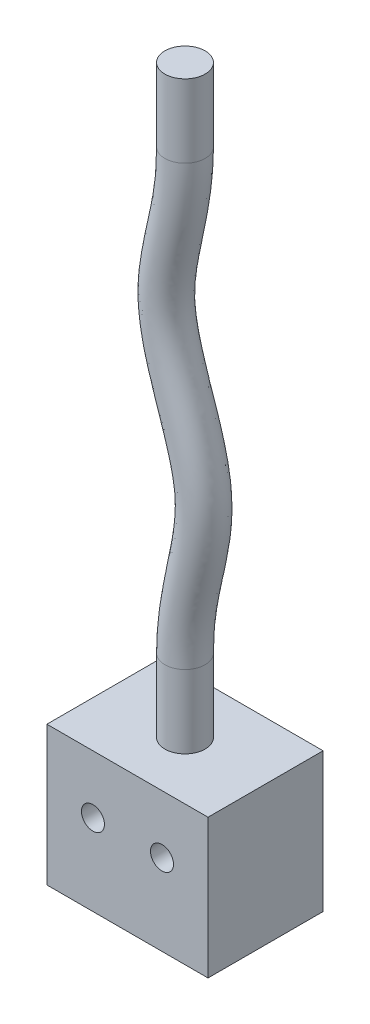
ISO-10303-21;
HEADER;
FILE_DESCRIPTION(('STEP AP214'),'2;1');
FILE_NAME('part.step','',(''),(''),'','','');
FILE_SCHEMA(('AUTOMOTIVE_DESIGN { 1 0 10303 214 1 1 1 1 }'));
ENDSEC;
DATA;
#1=APPLICATION_CONTEXT('core data for automotive mechanical design processes');
#2=APPLICATION_PROTOCOL_DEFINITION('international standard','automotive_design',2000,#1);
#3=PRODUCT_CONTEXT('',#1,'mechanical');
#4=PRODUCT('Part','Part','',(#3));
#5=PRODUCT_RELATED_PRODUCT_CATEGORY('part','',(#4));
#6=PRODUCT_DEFINITION_FORMATION('','',#4);
#7=PRODUCT_DEFINITION_CONTEXT('part definition',#1,'design');
#8=PRODUCT_DEFINITION('design','',#6,#7);
#9=PRODUCT_DEFINITION_SHAPE('','',#8);
#10=(LENGTH_UNIT() NAMED_UNIT(*) SI_UNIT(.MILLI.,.METRE.));
#11=(NAMED_UNIT(*) PLANE_ANGLE_UNIT() SI_UNIT($,.RADIAN.));
#12=(NAMED_UNIT(*) SI_UNIT($,.STERADIAN.) SOLID_ANGLE_UNIT());
#13=UNCERTAINTY_MEASURE_WITH_UNIT(LENGTH_MEASURE(1.E-05),#10,'distance_accuracy_value','');
#14=(GEOMETRIC_REPRESENTATION_CONTEXT(3) GLOBAL_UNCERTAINTY_ASSIGNED_CONTEXT((#13)) GLOBAL_UNIT_ASSIGNED_CONTEXT((#10,
#11,#12)) REPRESENTATION_CONTEXT('',''));
#15=CARTESIAN_POINT('',(0.,0.,0.));
#16=DIRECTION('',(0.,0.,1.));
#17=DIRECTION('',(1.,0.,0.));
#18=AXIS2_PLACEMENT_3D('',#15,#16,#17);
#19=CARTESIAN_POINT('',(-7.,6.05,5.));
#20=DIRECTION('',(0.,-1.,0.));
#21=DIRECTION('',(0.,0.,-1.));
#22=AXIS2_PLACEMENT_3D('',#19,#20,#21);
#23=PLANE('',#22);
#24=DIRECTION('',(-1.,0.,0.));
#25=VECTOR('',#24,1.);
#26=CARTESIAN_POINT('',(-7.,6.05,-5.));
#27=LINE('',#26,#25);
#28=CARTESIAN_POINT('',(7.,6.05,-5.));
#29=VERTEX_POINT('',#28);
#30=CARTESIAN_POINT('',(-7.,6.05,-5.));
#31=VERTEX_POINT('',#30);
#32=EDGE_CURVE('E89',#29,#31,#27,.T.);
#33=ORIENTED_EDGE('',*,*,#32,.T.);
#34=DIRECTION('',(0.,0.,-1.));
#35=VECTOR('',#34,1.);
#36=CARTESIAN_POINT('',(-7.,6.05,5.));
#37=LINE('',#36,#35);
#38=CARTESIAN_POINT('',(-7.,6.05,5.));
#39=VERTEX_POINT('',#38);
#40=EDGE_CURVE('E111',#39,#31,#37,.T.);
#41=ORIENTED_EDGE('',*,*,#40,.F.);
#42=DIRECTION('',(-1.,0.,0.));
#43=VECTOR('',#42,1.);
#44=CARTESIAN_POINT('',(-7.,6.05,5.));
#45=LINE('',#44,#43);
#46=CARTESIAN_POINT('',(7.,6.05,5.));
#47=VERTEX_POINT('',#46);
#48=EDGE_CURVE('E66',#47,#39,#45,.T.);
#49=ORIENTED_EDGE('',*,*,#48,.F.);
#50=DIRECTION('',(0.,0.,-1.));
#51=VECTOR('',#50,1.);
#52=CARTESIAN_POINT('',(7.,6.05,5.));
#53=LINE('',#52,#51);
#54=EDGE_CURVE('E108',#47,#29,#53,.T.);
#55=ORIENTED_EDGE('',*,*,#54,.T.);
#56=EDGE_LOOP('',(#33,#41,#49,#55));
#57=FACE_BOUND('',#56,.T.);
#58=CARTESIAN_POINT('',(0.,6.05,0.));
#59=DIRECTION('',(0.,1.,0.));
#60=DIRECTION('',(0.,0.,1.));
#61=AXIS2_PLACEMENT_3D('',#58,#59,#60);
#62=CIRCLE('',#61,1.75);
#63=CARTESIAN_POINT('',(0.,6.05,-1.75));
#64=VERTEX_POINT('',#63);
#65=EDGE_CURVE('E12',#64,#64,#62,.T.);
#66=ORIENTED_EDGE('',*,*,#65,.F.);
#67=EDGE_LOOP('',(#66));
#68=FACE_BOUND('',#67,.T.);
#69=ADVANCED_FACE('F48',(#57,#68),#23,.F.);
#70=CARTESIAN_POINT('',(-7.,6.05,5.));
#71=DIRECTION('',(1.,0.,0.));
#72=DIRECTION('',(0.,1.,0.));
#73=AXIS2_PLACEMENT_3D('',#70,#71,#72);
#74=PLANE('',#73);
#75=DIRECTION('',(0.,-1.,0.));
#76=VECTOR('',#75,1.);
#77=CARTESIAN_POINT('',(-7.,6.05,-5.));
#78=LINE('',#77,#76);
#79=CARTESIAN_POINT('',(-7.,-6.05,-5.));
#80=VERTEX_POINT('',#79);
#81=EDGE_CURVE('E115',#31,#80,#78,.T.);
#82=ORIENTED_EDGE('',*,*,#81,.T.);
#83=DIRECTION('',(0.,0.,-1.));
#84=VECTOR('',#83,1.);
#85=CARTESIAN_POINT('',(-7.,-6.05,5.));
#86=LINE('',#85,#84);
#87=CARTESIAN_POINT('',(-7.,-6.05,5.));
#88=VERTEX_POINT('',#87);
#89=EDGE_CURVE('E52',#88,#80,#86,.T.);
#90=ORIENTED_EDGE('',*,*,#89,.F.);
#91=DIRECTION('',(0.,-1.,0.));
#92=VECTOR('',#91,1.);
#93=CARTESIAN_POINT('',(-7.,6.05,5.));
#94=LINE('',#93,#92);
#95=EDGE_CURVE('E102',#39,#88,#94,.T.);
#96=ORIENTED_EDGE('',*,*,#95,.F.);
#97=ORIENTED_EDGE('',*,*,#40,.T.);
#98=EDGE_LOOP('',(#82,#90,#96,#97));
#99=FACE_BOUND('',#98,.T.);
#100=ADVANCED_FACE('F50',(#99),#74,.F.);
#101=CARTESIAN_POINT('',(-7.,-6.05,5.));
#102=DIRECTION('',(0.,1.,0.));
#103=DIRECTION('',(0.,0.,1.));
#104=AXIS2_PLACEMENT_3D('',#101,#102,#103);
#105=PLANE('',#104);
#106=DIRECTION('',(1.,0.,0.));
#107=VECTOR('',#106,1.);
#108=CARTESIAN_POINT('',(-7.,-6.05,-5.));
#109=LINE('',#108,#107);
#110=CARTESIAN_POINT('',(7.,-6.05,-5.));
#111=VERTEX_POINT('',#110);
#112=EDGE_CURVE('E107',#80,#111,#109,.T.);
#113=ORIENTED_EDGE('',*,*,#112,.T.);
#114=DIRECTION('',(0.,0.,-1.));
#115=VECTOR('',#114,1.);
#116=CARTESIAN_POINT('',(7.,-6.05,5.));
#117=LINE('',#116,#115);
#118=CARTESIAN_POINT('',(7.,-6.05,5.));
#119=VERTEX_POINT('',#118);
#120=EDGE_CURVE('E105',#119,#111,#117,.T.);
#121=ORIENTED_EDGE('',*,*,#120,.F.);
#122=DIRECTION('',(1.,0.,0.));
#123=VECTOR('',#122,1.);
#124=CARTESIAN_POINT('',(-7.,-6.05,5.));
#125=LINE('',#124,#123);
#126=EDGE_CURVE('E97',#88,#119,#125,.T.);
#127=ORIENTED_EDGE('',*,*,#126,.F.);
#128=ORIENTED_EDGE('',*,*,#89,.T.);
#129=EDGE_LOOP('',(#113,#121,#127,#128));
#130=FACE_BOUND('',#129,.T.);
#131=ADVANCED_FACE('F106',(#130),#105,.F.);
#132=CARTESIAN_POINT('',(7.,6.05,5.));
#133=DIRECTION('',(-1.,0.,0.));
#134=DIRECTION('',(0.,-1.,0.));
#135=AXIS2_PLACEMENT_3D('',#132,#133,#134);
#136=PLANE('',#135);
#137=DIRECTION('',(0.,1.,0.));
#138=VECTOR('',#137,1.);
#139=CARTESIAN_POINT('',(7.,6.05,-5.));
#140=LINE('',#139,#138);
#141=EDGE_CURVE('E83',#111,#29,#140,.T.);
#142=ORIENTED_EDGE('',*,*,#141,.T.);
#143=ORIENTED_EDGE('',*,*,#54,.F.);
#144=DIRECTION('',(0.,1.,0.));
#145=VECTOR('',#144,1.);
#146=CARTESIAN_POINT('',(7.,6.05,5.));
#147=LINE('',#146,#145);
#148=EDGE_CURVE('E100',#119,#47,#147,.T.);
#149=ORIENTED_EDGE('',*,*,#148,.F.);
#150=ORIENTED_EDGE('',*,*,#120,.T.);
#151=EDGE_LOOP('',(#142,#143,#149,#150));
#152=FACE_BOUND('',#151,.T.);
#153=ADVANCED_FACE('F109',(#152),#136,.F.);
#154=CARTESIAN_POINT('',(-7.,-6.05,5.));
#155=DIRECTION('',(0.,0.,1.));
#156=DIRECTION('',(1.,0.,0.));
#157=AXIS2_PLACEMENT_3D('',#154,#155,#156);
#158=PLANE('',#157);
#159=CARTESIAN_POINT('',(3.,1.,5.));
#160=DIRECTION('',(0.,0.,1.));
#161=DIRECTION('',(-1.,0.,0.));
#162=AXIS2_PLACEMENT_3D('',#159,#160,#161);
#163=CIRCLE('',#162,1.);
#164=CARTESIAN_POINT('',(2.,1.,5.));
#165=VERTEX_POINT('',#164);
#166=EDGE_CURVE('E135',#165,#165,#163,.T.);
#167=ORIENTED_EDGE('',*,*,#166,.F.);
#168=EDGE_LOOP('',(#167));
#169=FACE_BOUND('',#168,.T.);
#170=CARTESIAN_POINT('',(-3.,1.,5.));
#171=DIRECTION('',(0.,0.,1.));
#172=DIRECTION('',(1.,0.,0.));
#173=AXIS2_PLACEMENT_3D('',#170,#171,#172);
#174=CIRCLE('',#173,1.);
#175=CARTESIAN_POINT('',(-2.,1.,5.));
#176=VERTEX_POINT('',#175);
#177=EDGE_CURVE('E129',#176,#176,#174,.T.);
#178=ORIENTED_EDGE('',*,*,#177,.F.);
#179=EDGE_LOOP('',(#178));
#180=FACE_BOUND('',#179,.T.);
#181=ORIENTED_EDGE('',*,*,#95,.T.);
#182=ORIENTED_EDGE('',*,*,#126,.T.);
#183=ORIENTED_EDGE('',*,*,#148,.T.);
#184=ORIENTED_EDGE('',*,*,#48,.T.);
#185=EDGE_LOOP('',(#181,#182,#183,#184));
#186=FACE_BOUND('',#185,.T.);
#187=ADVANCED_FACE('F98',(#169,#180,#186),#158,.T.);
#188=CARTESIAN_POINT('',(-7.,-6.05,-5.));
#189=DIRECTION('',(0.,0.,1.));
#190=DIRECTION('',(1.,0.,0.));
#191=AXIS2_PLACEMENT_3D('',#188,#189,#190);
#192=PLANE('',#191);
#193=ORIENTED_EDGE('',*,*,#81,.F.);
#194=ORIENTED_EDGE('',*,*,#32,.F.);
#195=ORIENTED_EDGE('',*,*,#141,.F.);
#196=ORIENTED_EDGE('',*,*,#112,.F.);
#197=EDGE_LOOP('',(#193,#194,#195,#196));
#198=FACE_BOUND('',#197,.T.);
#199=ADVANCED_FACE('F126',(#198),#192,.F.);
#200=CARTESIAN_POINT('',(-3.,1.,0.));
#201=DIRECTION('',(0.,0.,1.));
#202=DIRECTION('',(1.,0.,0.));
#203=AXIS2_PLACEMENT_3D('',#200,#201,#202);
#204=CYLINDRICAL_SURFACE('',#203,1.);
#205=CARTESIAN_POINT('',(-3.,1.,0.));
#206=DIRECTION('',(0.,0.,1.));
#207=DIRECTION('',(1.,0.,0.));
#208=AXIS2_PLACEMENT_3D('',#205,#206,#207);
#209=CIRCLE('',#208,1.);
#210=CARTESIAN_POINT('',(-2.,1.,0.));
#211=VERTEX_POINT('',#210);
#212=EDGE_CURVE('E118',#211,#211,#209,.T.);
#213=ORIENTED_EDGE('',*,*,#212,.F.);
#214=EDGE_LOOP('',(#213));
#215=FACE_BOUND('',#214,.T.);
#216=ORIENTED_EDGE('',*,*,#177,.T.);
#217=EDGE_LOOP('',(#216));
#218=FACE_BOUND('',#217,.T.);
#219=ADVANCED_FACE('F197',(#215,#218),#204,.F.);
#220=CARTESIAN_POINT('',(-3.,1.,0.));
#221=DIRECTION('',(0.,0.,1.));
#222=DIRECTION('',(1.,0.,0.));
#223=AXIS2_PLACEMENT_3D('',#220,#221,#222);
#224=PLANE('',#223);
#225=ORIENTED_EDGE('',*,*,#212,.T.);
#226=EDGE_LOOP('',(#225));
#227=FACE_BOUND('',#226,.T.);
#228=ADVANCED_FACE('F202',(#227),#224,.T.);
#229=CARTESIAN_POINT('',(3.,1.,0.));
#230=DIRECTION('',(0.,0.,1.));
#231=DIRECTION('',(1.,0.,0.));
#232=AXIS2_PLACEMENT_3D('',#229,#230,#231);
#233=CYLINDRICAL_SURFACE('',#232,1.);
#234=CARTESIAN_POINT('',(3.,1.,0.));
#235=DIRECTION('',(0.,0.,1.));
#236=DIRECTION('',(-1.,0.,0.));
#237=AXIS2_PLACEMENT_3D('',#234,#235,#236);
#238=CIRCLE('',#237,1.);
#239=CARTESIAN_POINT('',(2.,1.,0.));
#240=VERTEX_POINT('',#239);
#241=EDGE_CURVE('E132',#240,#240,#238,.T.);
#242=ORIENTED_EDGE('',*,*,#241,.F.);
#243=EDGE_LOOP('',(#242));
#244=FACE_BOUND('',#243,.T.);
#245=ORIENTED_EDGE('',*,*,#166,.T.);
#246=EDGE_LOOP('',(#245));
#247=FACE_BOUND('',#246,.T.);
#248=ADVANCED_FACE('F210',(#244,#247),#233,.F.);
#249=CARTESIAN_POINT('',(3.,1.,0.));
#250=DIRECTION('',(0.,0.,-1.));
#251=DIRECTION('',(-1.,0.,0.));
#252=AXIS2_PLACEMENT_3D('',#249,#250,#251);
#253=PLANE('',#252);
#254=ORIENTED_EDGE('',*,*,#241,.T.);
#255=EDGE_LOOP('',(#254));
#256=FACE_BOUND('',#255,.T.);
#257=ADVANCED_FACE('F218',(#256),#253,.F.);
#258=CARTESIAN_POINT('',(0.,50.5,0.));
#259=DIRECTION('',(0.,1.,0.));
#260=DIRECTION('',(-1.,0.,0.));
#261=AXIS2_PLACEMENT_3D('',#258,#259,#260);
#262=CYLINDRICAL_SURFACE('',#261,1.75);
#263=CARTESIAN_POINT('',(0.,50.5,0.));
#264=DIRECTION('',(0.,1.,0.));
#265=DIRECTION('',(0.,0.,1.));
#266=AXIS2_PLACEMENT_3D('',#263,#264,#265);
#267=CIRCLE('',#266,1.75);
#268=CARTESIAN_POINT('',(0.,50.5,1.75));
#269=VERTEX_POINT('',#268);
#270=EDGE_CURVE('E146',#269,#269,#267,.T.);
#271=ORIENTED_EDGE('',*,*,#270,.T.);
#272=EDGE_LOOP('',(#271));
#273=FACE_BOUND('',#272,.T.);
#274=CARTESIAN_POINT('',(0.,56.85,0.));
#275=DIRECTION('',(0.,1.,0.));
#276=DIRECTION('',(0.,0.,1.));
#277=AXIS2_PLACEMENT_3D('',#274,#275,#276);
#278=CIRCLE('',#277,1.75);
#279=CARTESIAN_POINT('',(0.,56.85,1.75));
#280=VERTEX_POINT('',#279);
#281=EDGE_CURVE('E138',#280,#280,#278,.T.);
#282=ORIENTED_EDGE('',*,*,#281,.F.);
#283=EDGE_LOOP('',(#282));
#284=FACE_BOUND('',#283,.T.);
#285=ADVANCED_FACE('F150',(#273,#284),#262,.T.);
#286=CARTESIAN_POINT('',(0.,12.4,0.));
#287=DIRECTION('',(0.,-1.,0.));
#288=DIRECTION('',(0.,0.,-1.));
#289=AXIS2_PLACEMENT_3D('',#286,#287,#288);
#290=CYLINDRICAL_SURFACE('',#289,1.75);
#291=CARTESIAN_POINT('',(0.,12.4,0.));
#292=DIRECTION('',(0.,1.,0.));
#293=DIRECTION('',(0.,0.,1.));
#294=AXIS2_PLACEMENT_3D('',#291,#292,#293);
#295=CIRCLE('',#294,1.75);
#296=CARTESIAN_POINT('',(0.,12.4,-1.75));
#297=VERTEX_POINT('',#296);
#298=EDGE_CURVE('E142',#297,#297,#295,.T.);
#299=CARTESIAN_POINT('',(0.,12.4,-1.75));
#300=CARTESIAN_POINT('',(0.,12.3338541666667,-1.75));
#301=CARTESIAN_POINT('',(0.,12.2677083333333,-1.75));
#302=CARTESIAN_POINT('',(0.,12.1354166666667,-1.75));
#303=CARTESIAN_POINT('',(0.,12.0692708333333,-1.75));
#304=CARTESIAN_POINT('',(0.,11.9369791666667,-1.75));
#305=CARTESIAN_POINT('',(0.,11.8708333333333,-1.75));
#306=CARTESIAN_POINT('',(0.,11.7385416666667,-1.75));
#307=CARTESIAN_POINT('',(0.,11.6723958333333,-1.75));
#308=CARTESIAN_POINT('',(0.,11.5401041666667,-1.75));
#309=CARTESIAN_POINT('',(0.,11.4739583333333,-1.75));
#310=CARTESIAN_POINT('',(0.,11.3416666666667,-1.75));
#311=CARTESIAN_POINT('',(0.,11.2755208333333,-1.75));
#312=CARTESIAN_POINT('',(0.,11.1432291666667,-1.75));
#313=CARTESIAN_POINT('',(0.,11.0770833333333,-1.75));
#314=CARTESIAN_POINT('',(0.,10.9447916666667,-1.75));
#315=CARTESIAN_POINT('',(0.,10.8786458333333,-1.75));
#316=CARTESIAN_POINT('',(0.,10.7463541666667,-1.75));
#317=CARTESIAN_POINT('',(0.,10.6802083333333,-1.75));
#318=CARTESIAN_POINT('',(0.,10.5479166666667,-1.75));
#319=CARTESIAN_POINT('',(0.,10.4817708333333,-1.75));
#320=CARTESIAN_POINT('',(0.,10.3494791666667,-1.75));
#321=CARTESIAN_POINT('',(0.,10.2833333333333,-1.75));
#322=CARTESIAN_POINT('',(0.,10.1510416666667,-1.75));
#323=CARTESIAN_POINT('',(0.,10.0848958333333,-1.75));
#324=CARTESIAN_POINT('',(0.,9.95260416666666,-1.75));
#325=CARTESIAN_POINT('',(0.,9.88645833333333,-1.75));
#326=CARTESIAN_POINT('',(0.,9.75416666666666,-1.75));
#327=CARTESIAN_POINT('',(0.,9.68802083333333,-1.75));
#328=CARTESIAN_POINT('',(0.,9.55572916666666,-1.75));
#329=CARTESIAN_POINT('',(0.,9.48958333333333,-1.75));
#330=CARTESIAN_POINT('',(0.,9.35729166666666,-1.75));
#331=CARTESIAN_POINT('',(0.,9.29114583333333,-1.75));
#332=CARTESIAN_POINT('',(0.,9.15885416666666,-1.75));
#333=CARTESIAN_POINT('',(0.,9.09270833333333,-1.75));
#334=CARTESIAN_POINT('',(0.,8.96041666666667,-1.75));
#335=CARTESIAN_POINT('',(0.,8.89427083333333,-1.75));
#336=CARTESIAN_POINT('',(0.,8.76197916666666,-1.75));
#337=CARTESIAN_POINT('',(0.,8.69583333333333,-1.75));
#338=CARTESIAN_POINT('',(0.,8.56354166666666,-1.75));
#339=CARTESIAN_POINT('',(0.,8.49739583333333,-1.75));
#340=CARTESIAN_POINT('',(0.,8.36510416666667,-1.75));
#341=CARTESIAN_POINT('',(0.,8.29895833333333,-1.75));
#342=CARTESIAN_POINT('',(0.,8.16666666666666,-1.75));
#343=CARTESIAN_POINT('',(0.,8.10052083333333,-1.75));
#344=CARTESIAN_POINT('',(0.,7.96822916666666,-1.75));
#345=CARTESIAN_POINT('',(0.,7.90208333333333,-1.75));
#346=CARTESIAN_POINT('',(0.,7.76979166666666,-1.75));
#347=CARTESIAN_POINT('',(0.,7.70364583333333,-1.75));
#348=CARTESIAN_POINT('',(0.,7.57135416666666,-1.75));
#349=CARTESIAN_POINT('',(0.,7.50520833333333,-1.75));
#350=CARTESIAN_POINT('',(0.,7.37291666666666,-1.75));
#351=CARTESIAN_POINT('',(0.,7.30677083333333,-1.75));
#352=CARTESIAN_POINT('',(0.,7.17447916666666,-1.75));
#353=CARTESIAN_POINT('',(0.,7.10833333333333,-1.75));
#354=CARTESIAN_POINT('',(0.,6.97604166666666,-1.75));
#355=CARTESIAN_POINT('',(0.,6.90989583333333,-1.75));
#356=CARTESIAN_POINT('',(0.,6.77760416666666,-1.75));
#357=CARTESIAN_POINT('',(0.,6.71145833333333,-1.75));
#358=CARTESIAN_POINT('',(0.,6.57916666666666,-1.75));
#359=CARTESIAN_POINT('',(0.,6.51302083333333,-1.75));
#360=CARTESIAN_POINT('',(0.,6.38072916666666,-1.75));
#361=CARTESIAN_POINT('',(0.,6.31458333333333,-1.75));
#362=CARTESIAN_POINT('',(0.,6.18229166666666,-1.75));
#363=CARTESIAN_POINT('',(0.,6.11614583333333,-1.75));
#364=CARTESIAN_POINT('',(0.,6.05,-1.75));
#365=B_SPLINE_CURVE_WITH_KNOTS('',3,(#299,#300,#301,#302,#303,#304,#305,#306,#307,#308,#309,
#310,#311,#312,#313,#314,#315,#316,#317,#318,#319,#320,#321,#322,#323,#324,#325,#326,#327,#328,
#329,#330,#331,#332,#333,#334,#335,#336,#337,#338,#339,#340,#341,#342,#343,#344,#345,#346,#347,
#348,#349,#350,#351,#352,#353,#354,#355,#356,#357,#358,#359,#360,#361,#362,#363,#364),
.UNSPECIFIED.,.F.,.F.,(4,2,2,2,2,2,2,2,2,2,2,2,2,2,2,2,2,2,2,2,2,2,2,2,2,2,2,2,2,2,2,2,4),(0.,
0.198437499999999,0.396875,0.595312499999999,0.793749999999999,0.992187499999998,1.190625,
1.3890625,1.5875,1.7859375,1.984375,2.1828125,2.38125,2.5796875,2.778125,2.9765625,3.175,
3.3734375,3.571875,3.7703125,3.96875,4.1671875,4.365625,4.5640625,4.7625,4.9609375,5.159375,
5.3578125,5.55625,5.7546875,5.953125,6.1515625,6.35),.UNSPECIFIED.);
#366=EDGE_CURVE('BSEAM161',#297,#64,#365,.T.);
#367=ORIENTED_EDGE('',*,*,#298,.F.);
#368=ORIENTED_EDGE('',*,*,#65,.T.);
#369=ORIENTED_EDGE('',*,*,#366,.T.);
#370=ORIENTED_EDGE('',*,*,#366,.F.);
#371=EDGE_LOOP('',(#367,#369,#368,#370));
#372=FACE_BOUND('',#371,.T.);
#373=ADVANCED_FACE('F161',(#372),#290,.T.);
#374=CARTESIAN_POINT('',(0.,56.85,0.));
#375=DIRECTION('',(0.,1.,0.));
#376=DIRECTION('',(0.,0.,1.));
#377=AXIS2_PLACEMENT_3D('',#374,#375,#376);
#378=PLANE('',#377);
#379=ORIENTED_EDGE('',*,*,#281,.T.);
#380=EDGE_LOOP('',(#379));
#381=FACE_BOUND('',#380,.T.);
#382=ADVANCED_FACE('F155',(#381),#378,.T.);
#383=CARTESIAN_POINT('',(0.,12.4,1.75));
#384=CARTESIAN_POINT('',(0.,14.5840851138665,1.75));
#385=CARTESIAN_POINT('',(0.673718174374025,18.372697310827,1.75));
#386=CARTESIAN_POINT('',(1.6091598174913,22.2213143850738,1.75));
#387=CARTESIAN_POINT('',(1.64351345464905,25.5446698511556,1.75));
#388=CARTESIAN_POINT('',(0.899052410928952,29.030360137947,1.75));
#389=CARTESIAN_POINT('',(-0.729124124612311,33.3880527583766,1.75));
#390=CARTESIAN_POINT('',(-1.60521870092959,36.959787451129,1.75));
#391=CARTESIAN_POINT('',(-1.64693404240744,40.4228730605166,1.75));
#392=CARTESIAN_POINT('',(-0.739409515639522,44.2008563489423,1.75));
#393=CARTESIAN_POINT('',(0.,48.1653714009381,1.75));
#394=CARTESIAN_POINT('',(0.,50.5,1.75));
#395=CARTESIAN_POINT('',(3.5,12.4,1.75));
#396=CARTESIAN_POINT('',(3.5,14.5840851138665,1.75));
#397=CARTESIAN_POINT('',(4.03051799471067,17.2631833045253,1.75));
#398=CARTESIAN_POINT('',(5.12697413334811,21.6762781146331,1.75));
#399=CARTESIAN_POINT('',(5.10649050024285,25.8687726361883,1.75));
#400=CARTESIAN_POINT('',(4.23810356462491,30.2247268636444,1.75));
#401=CARTESIAN_POINT('',(2.57044853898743,34.6433214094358,1.75));
#402=CARTESIAN_POINT('',(1.8578424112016,37.365722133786,1.75));
#403=CARTESIAN_POINT('',(1.88028100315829,39.9609570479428,1.75));
#404=CARTESIAN_POINT('',(2.60631479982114,43.0263243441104,1.75));
#405=CARTESIAN_POINT('',(3.5,48.1653714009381,1.75));
#406=CARTESIAN_POINT('',(3.5,50.5,1.75));
#407=CARTESIAN_POINT('',(3.5,12.4,-1.75));
#408=CARTESIAN_POINT('',(3.5,14.5840851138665,-1.75));
#409=CARTESIAN_POINT('',(4.03051799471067,17.2631833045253,-1.75));
#410=CARTESIAN_POINT('',(5.12697413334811,21.6762781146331,-1.75));
#411=CARTESIAN_POINT('',(5.10649050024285,25.8687726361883,-1.75));
#412=CARTESIAN_POINT('',(4.23810356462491,30.2247268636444,-1.75));
#413=CARTESIAN_POINT('',(2.57044853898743,34.6433214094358,-1.75));
#414=CARTESIAN_POINT('',(1.8578424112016,37.365722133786,-1.75));
#415=CARTESIAN_POINT('',(1.88028100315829,39.9609570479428,-1.75));
#416=CARTESIAN_POINT('',(2.60631479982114,43.0263243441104,-1.75));
#417=CARTESIAN_POINT('',(3.5,48.1653714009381,-1.75));
#418=CARTESIAN_POINT('',(3.5,50.5,-1.75));
#419=CARTESIAN_POINT('',(0.,12.4,-1.75));
#420=CARTESIAN_POINT('',(0.,14.5840851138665,-1.75));
#421=CARTESIAN_POINT('',(0.673718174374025,18.372697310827,-1.75));
#422=CARTESIAN_POINT('',(1.6091598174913,22.2213143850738,-1.75));
#423=CARTESIAN_POINT('',(1.64351345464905,25.5446698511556,-1.75));
#424=CARTESIAN_POINT('',(0.899052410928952,29.030360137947,-1.75));
#425=CARTESIAN_POINT('',(-0.729124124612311,33.3880527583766,-1.75));
#426=CARTESIAN_POINT('',(-1.60521870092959,36.959787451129,-1.75));
#427=CARTESIAN_POINT('',(-1.64693404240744,40.4228730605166,-1.75));
#428=CARTESIAN_POINT('',(-0.739409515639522,44.2008563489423,-1.75));
#429=CARTESIAN_POINT('',(0.,48.1653714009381,-1.75));
#430=CARTESIAN_POINT('',(0.,50.5,-1.75));
#431=CARTESIAN_POINT('',(-3.5,12.4,-1.75));
#432=CARTESIAN_POINT('',(-3.5,14.5840851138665,-1.75));
#433=CARTESIAN_POINT('',(-2.68308164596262,19.4822113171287,-1.75));
#434=CARTESIAN_POINT('',(-1.90865449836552,22.7663506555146,-1.75));
#435=CARTESIAN_POINT('',(-1.81946359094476,25.2205670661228,-1.75));
#436=CARTESIAN_POINT('',(-2.43999874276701,27.8359934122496,-1.75));
#437=CARTESIAN_POINT('',(-4.02869678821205,32.1327841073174,-1.75));
#438=CARTESIAN_POINT('',(-5.06827981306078,36.553852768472,-1.75));
#439=CARTESIAN_POINT('',(-5.17414908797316,40.8847890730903,-1.75));
#440=CARTESIAN_POINT('',(-4.08513383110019,45.3753883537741,-1.75));
#441=CARTESIAN_POINT('',(-3.5,48.1653714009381,-1.75));
#442=CARTESIAN_POINT('',(-3.5,50.5,-1.75));
#443=CARTESIAN_POINT('',(-3.5,12.4,1.75));
#444=CARTESIAN_POINT('',(-3.5,14.5840851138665,1.75));
#445=CARTESIAN_POINT('',(-2.68308164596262,19.4822113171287,1.75));
#446=CARTESIAN_POINT('',(-1.90865449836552,22.7663506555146,1.75));
#447=CARTESIAN_POINT('',(-1.81946359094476,25.2205670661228,1.75));
#448=CARTESIAN_POINT('',(-2.43999874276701,27.8359934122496,1.75));
#449=CARTESIAN_POINT('',(-4.02869678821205,32.1327841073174,1.75));
#450=CARTESIAN_POINT('',(-5.06827981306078,36.553852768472,1.75));
#451=CARTESIAN_POINT('',(-5.17414908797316,40.8847890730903,1.75));
#452=CARTESIAN_POINT('',(-4.08513383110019,45.3753883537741,1.75));
#453=CARTESIAN_POINT('',(-3.5,48.1653714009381,1.75));
#454=CARTESIAN_POINT('',(-3.5,50.5,1.75));
#455=CARTESIAN_POINT('',(0.,12.4,1.75));
#456=CARTESIAN_POINT('',(0.,14.5840851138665,1.75));
#457=CARTESIAN_POINT('',(0.673718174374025,18.372697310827,1.75));
#458=CARTESIAN_POINT('',(1.6091598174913,22.2213143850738,1.75));
#459=CARTESIAN_POINT('',(1.64351345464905,25.5446698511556,1.75));
#460=CARTESIAN_POINT('',(0.899052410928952,29.030360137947,1.75));
#461=CARTESIAN_POINT('',(-0.729124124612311,33.3880527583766,1.75));
#462=CARTESIAN_POINT('',(-1.60521870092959,36.959787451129,1.75));
#463=CARTESIAN_POINT('',(-1.64693404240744,40.4228730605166,1.75));
#464=CARTESIAN_POINT('',(-0.739409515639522,44.2008563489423,1.75));
#465=CARTESIAN_POINT('',(0.,48.1653714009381,1.75));
#466=CARTESIAN_POINT('',(0.,50.5,1.75));
#467=(BOUNDED_SURFACE() B_SPLINE_SURFACE(3,3,((#383,#384,#385,#386,#387,#388,#389,#390,#391,
#392,#393,#394),(#395,#396,#397,#398,#399,#400,#401,#402,#403,#404,#405,#406),(#407,#408,#409,
#410,#411,#412,#413,#414,#415,#416,#417,#418),(#419,#420,#421,#422,#423,#424,#425,#426,#427,
#428,#429,#430),(#431,#432,#433,#434,#435,#436,#437,#438,#439,#440,#441,#442),(#443,#444,#445,
#446,#447,#448,#449,#450,#451,#452,#453,#454),(#455,#456,#457,#458,#459,#460,#461,#462,#463,
#464,#465,#466)),.UNSPECIFIED.,.T.,.F.,.F.) B_SPLINE_SURFACE_WITH_KNOTS((4,3,4),(4,1,1,1,1,1,1,
1,1,4),(0.,0.5,1.),(0.,0.14,0.28,0.330817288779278,0.420000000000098,0.559999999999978,
0.669182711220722,0.706666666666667,0.853333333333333,1.),
.UNSPECIFIED.) GEOMETRIC_REPRESENTATION_ITEM() RATIONAL_B_SPLINE_SURFACE(((1.,1.,1.,1.,1.,1.,1.,
1.,1.,1.,1.,1.),(0.333333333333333,0.333333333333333,0.333333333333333,0.333333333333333,
0.333333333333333,0.333333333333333,0.333333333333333,0.333333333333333,0.333333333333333,
0.333333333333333,0.333333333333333,0.333333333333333),(0.333333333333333,0.333333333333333,
0.333333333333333,0.333333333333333,0.333333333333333,0.333333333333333,0.333333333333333,
0.333333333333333,0.333333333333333,0.333333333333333,0.333333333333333,0.333333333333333),(1.,
1.,1.,1.,1.,1.,1.,1.,1.,1.,1.,1.),(0.333333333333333,0.333333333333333,0.333333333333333,
0.333333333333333,0.333333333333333,0.333333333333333,0.333333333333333,0.333333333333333,
0.333333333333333,0.333333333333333,0.333333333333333,0.333333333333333),(0.333333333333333,
0.333333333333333,0.333333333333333,0.333333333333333,0.333333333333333,0.333333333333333,
0.333333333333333,0.333333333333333,0.333333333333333,0.333333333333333,0.333333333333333,
0.333333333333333),(1.,1.,1.,1.,1.,1.,1.,1.,1.,1.,1.,1.))) REPRESENTATION_ITEM('') SURFACE());
#468=ORIENTED_EDGE('',*,*,#298,.T.);
#469=EDGE_LOOP('',(#468));
#470=FACE_BOUND('',#469,.T.);
#471=ORIENTED_EDGE('',*,*,#270,.F.);
#472=EDGE_LOOP('',(#471));
#473=FACE_BOUND('',#472,.T.);
#474=ADVANCED_FACE('F153',(#470,#473),#467,.T.);
#475=CLOSED_SHELL('',(#69,#100,#131,#153,#187,#199,#219,#228,#248,#257,#285,#373,#382,#474));
#476=MANIFOLD_SOLID_BREP('B2',#475);
#477=ADVANCED_BREP_SHAPE_REPRESENTATION('',(#18,#476),#14);
#478=SHAPE_DEFINITION_REPRESENTATION(#9,#477);
ENDSEC;
END-ISO-10303-21;
